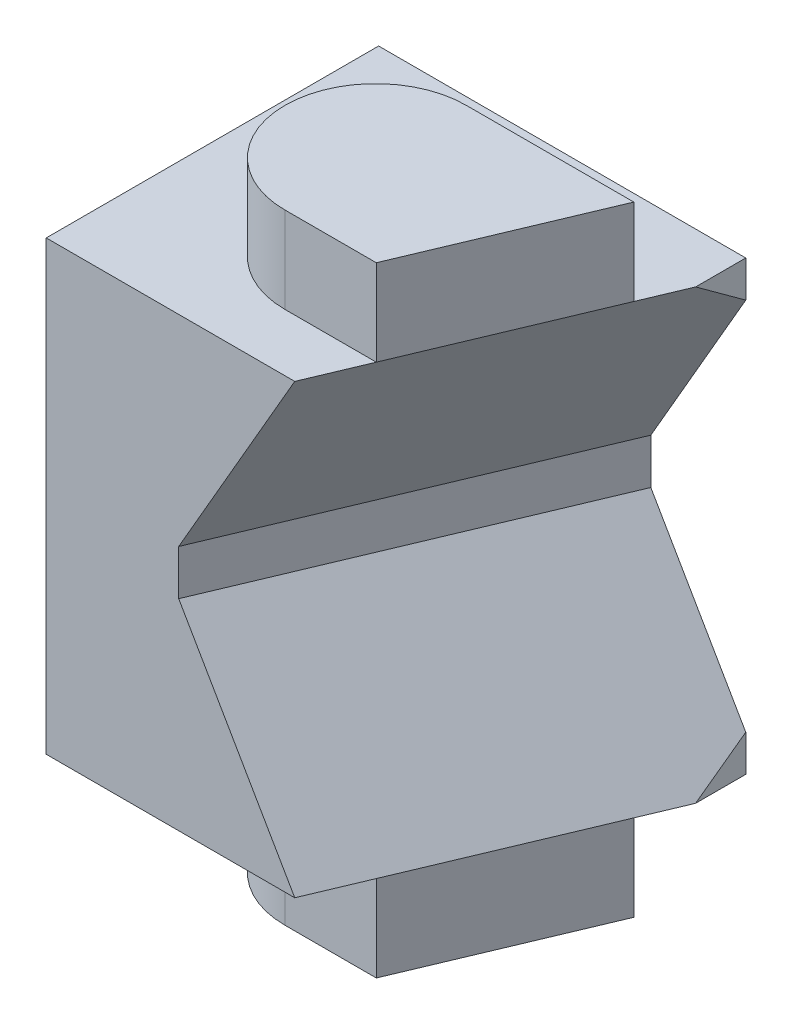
ISO-10303-21;
HEADER;
FILE_DESCRIPTION(('STEP AP214'),'2;1');
FILE_NAME('part.step','',(''),(''),'','','');
FILE_SCHEMA(('AUTOMOTIVE_DESIGN { 1 0 10303 214 1 1 1 1 }'));
ENDSEC;
DATA;
#1=APPLICATION_CONTEXT('core data for automotive mechanical design processes');
#2=APPLICATION_PROTOCOL_DEFINITION('international standard','automotive_design',2000,#1);
#3=PRODUCT_CONTEXT('',#1,'mechanical');
#4=PRODUCT('Part','Part','',(#3));
#5=PRODUCT_RELATED_PRODUCT_CATEGORY('part','',(#4));
#6=PRODUCT_DEFINITION_FORMATION('','',#4);
#7=PRODUCT_DEFINITION_CONTEXT('part definition',#1,'design');
#8=PRODUCT_DEFINITION('design','',#6,#7);
#9=PRODUCT_DEFINITION_SHAPE('','',#8);
#10=(LENGTH_UNIT() NAMED_UNIT(*) SI_UNIT(.MILLI.,.METRE.));
#11=(NAMED_UNIT(*) PLANE_ANGLE_UNIT() SI_UNIT($,.RADIAN.));
#12=(NAMED_UNIT(*) SI_UNIT($,.STERADIAN.) SOLID_ANGLE_UNIT());
#13=UNCERTAINTY_MEASURE_WITH_UNIT(LENGTH_MEASURE(1.E-05),#10,'distance_accuracy_value','');
#14=(GEOMETRIC_REPRESENTATION_CONTEXT(3) GLOBAL_UNCERTAINTY_ASSIGNED_CONTEXT((#13)) GLOBAL_UNIT_ASSIGNED_CONTEXT((#10,
#11,#12)) REPRESENTATION_CONTEXT('',''));
#15=CARTESIAN_POINT('',(0.,0.,0.));
#16=DIRECTION('',(0.,0.,1.));
#17=DIRECTION('',(1.,0.,0.));
#18=AXIS2_PLACEMENT_3D('',#15,#16,#17);
#19=CARTESIAN_POINT('',(-1.50000000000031,0.,10.9999999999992));
#20=DIRECTION('',(-1.,0.,0.));
#21=DIRECTION('',(0.,0.27243634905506,-0.962173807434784));
#22=AXIS2_PLACEMENT_3D('',#19,#20,#21);
#23=CYLINDRICAL_SURFACE('',#22,7.);
#24=CARTESIAN_POINT('',(-2.50000000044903,0.,10.9999999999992));
#25=DIRECTION('',(1.,0.,0.));
#26=DIRECTION('',(0.,-0.27243634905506,0.962173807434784));
#27=AXIS2_PLACEMENT_3D('',#24,#25,#26);
#28=CIRCLE('',#27,7.00000000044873);
#29=CARTESIAN_POINT('',(-2.50000000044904,-1.90705444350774,17.7352166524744));
#30=VERTEX_POINT('',#29);
#31=EDGE_CURVE('E215',#30,#30,#28,.T.);
#32=ORIENTED_EDGE('',*,*,#31,.F.);
#33=EDGE_LOOP('',(#32));
#34=FACE_BOUND('',#33,.T.);
#35=CARTESIAN_POINT('',(-3.30000000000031,0.,10.9999999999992));
#36=DIRECTION('',(-1.,0.,0.));
#37=DIRECTION('',(0.,-1.,0.));
#38=AXIS2_PLACEMENT_3D('',#35,#36,#37);
#39=CIRCLE('',#38,7.);
#40=CARTESIAN_POINT('',(-3.30000000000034,-7.00000000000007,10.9999999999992));
#41=VERTEX_POINT('',#40);
#42=EDGE_CURVE('E364',#41,#41,#39,.T.);
#43=ORIENTED_EDGE('',*,*,#42,.F.);
#44=EDGE_LOOP('',(#43));
#45=FACE_BOUND('',#44,.T.);
#46=ADVANCED_FACE('F14',(#34,#45),#23,.T.);
#47=CARTESIAN_POINT('',(4.99999999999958,-14.8,-0.200000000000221));
#48=DIRECTION('',(0.,-1.,0.));
#49=DIRECTION('',(-1.,0.,0.));
#50=AXIS2_PLACEMENT_3D('',#47,#48,#49);
#51=PLANE('',#50);
#52=CARTESIAN_POINT('',(11.9999999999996,-14.8000000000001,12.2));
#53=DIRECTION('',(0.,1.,0.));
#54=DIRECTION('',(1.,0.,0.));
#55=AXIS2_PLACEMENT_3D('',#52,#53,#54);
#56=CIRCLE('',#55,6.);
#57=CARTESIAN_POINT('',(11.9999999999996,-14.8,6.19999999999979));
#58=VERTEX_POINT('',#57);
#59=CARTESIAN_POINT('',(11.9999999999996,-14.8000000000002,18.2));
#60=VERTEX_POINT('',#59);
#61=EDGE_CURVE('E31',#58,#60,#56,.T.);
#62=ORIENTED_EDGE('',*,*,#61,.T.);
#63=DIRECTION('',(1.,0.,0.));
#64=VECTOR('',#63,1.);
#65=CARTESIAN_POINT('',(11.9999999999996,-14.8000000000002,18.2));
#66=LINE('',#65,#64);
#67=CARTESIAN_POINT('',(18.0456686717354,-14.8000000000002,18.2));
#68=VERTEX_POINT('',#67);
#69=EDGE_CURVE('E159',#60,#68,#66,.T.);
#70=ORIENTED_EDGE('',*,*,#69,.T.);
#71=DIRECTION('',(-0.387449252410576,0.,0.921891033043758));
#72=VECTOR('',#71,1.);
#73=CARTESIAN_POINT('',(24.2999999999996,-14.8,3.31853634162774));
#74=LINE('',#73,#72);
#75=CARTESIAN_POINT('',(16.4486174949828,-14.8000000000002,22.));
#76=VERTEX_POINT('',#75);
#77=EDGE_CURVE('E158',#68,#76,#74,.T.);
#78=ORIENTED_EDGE('',*,*,#77,.T.);
#79=DIRECTION('',(-1.,0.,0.));
#80=VECTOR('',#79,1.);
#81=CARTESIAN_POINT('',(4.99999999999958,-14.8000000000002,22.));
#82=LINE('',#81,#80);
#83=CARTESIAN_POINT('',(-4.22037385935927E-13,-14.8000000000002,22.));
#84=VERTEX_POINT('',#83);
#85=EDGE_CURVE('E164',#76,#84,#82,.T.);
#86=ORIENTED_EDGE('',*,*,#85,.T.);
#87=DIRECTION('',(0.,0.,-1.));
#88=VECTOR('',#87,1.);
#89=CARTESIAN_POINT('',(-4.22037385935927E-13,-14.8,-0.200000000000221));
#90=LINE('',#89,#88);
#91=CARTESIAN_POINT('',(-4.22037385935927E-13,-14.8,-2.10900703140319E-13));
#92=VERTEX_POINT('',#91);
#93=EDGE_CURVE('E166',#84,#92,#90,.T.);
#94=ORIENTED_EDGE('',*,*,#93,.T.);
#95=DIRECTION('',(1.,0.,0.));
#96=VECTOR('',#95,1.);
#97=CARTESIAN_POINT('',(14.0228679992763,-14.8,-2.10900703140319E-13));
#98=LINE('',#97,#96);
#99=CARTESIAN_POINT('',(24.2999999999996,-14.8,-2.14370150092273E-13));
#100=VERTEX_POINT('',#99);
#101=EDGE_CURVE('E212',#100,#92,#98,.F.);
#102=ORIENTED_EDGE('',*,*,#101,.F.);
#103=DIRECTION('',(0.,0.,-1.));
#104=VECTOR('',#103,1.);
#105=CARTESIAN_POINT('',(24.2999999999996,-14.8,-0.200000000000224));
#106=LINE('',#105,#104);
#107=CARTESIAN_POINT('',(24.2999999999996,-14.8,3.31853634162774));
#108=VERTEX_POINT('',#107);
#109=EDGE_CURVE('E163',#100,#108,#106,.F.);
#110=ORIENTED_EDGE('',*,*,#109,.T.);
#111=CARTESIAN_POINT('',(23.0889881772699,-14.8000000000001,6.19999999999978));
#112=VERTEX_POINT('',#111);
#113=EDGE_CURVE('E155',#108,#112,#74,.T.);
#114=ORIENTED_EDGE('',*,*,#113,.T.);
#115=DIRECTION('',(-1.,0.,0.));
#116=VECTOR('',#115,1.);
#117=CARTESIAN_POINT('',(11.9999999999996,-14.8,6.19999999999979));
#118=LINE('',#117,#116);
#119=EDGE_CURVE('E146',#112,#58,#118,.T.);
#120=ORIENTED_EDGE('',*,*,#119,.T.);
#121=EDGE_LOOP('',(#62,#70,#78,#86,#94,#102,#110,#114,#120));
#122=FACE_BOUND('',#121,.T.);
#123=ADVANCED_FACE('F161',(#122),#51,.T.);
#124=CARTESIAN_POINT('',(4.99999999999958,-14.8000000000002,22.));
#125=DIRECTION('',(0.,0.,1.));
#126=DIRECTION('',(-1.,0.,0.));
#127=AXIS2_PLACEMENT_3D('',#124,#125,#126);
#128=PLANE('',#127);
#129=DIRECTION('',(0.,1.,0.));
#130=VECTOR('',#129,1.);
#131=CARTESIAN_POINT('',(-3.18689538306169E-13,14.8,22.));
#132=LINE('',#131,#130);
#133=CARTESIAN_POINT('',(-3.18689538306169E-13,14.8,22.));
#134=VERTEX_POINT('',#133);
#135=EDGE_CURVE('E203',#84,#134,#132,.T.);
#136=ORIENTED_EDGE('',*,*,#135,.F.);
#137=ORIENTED_EDGE('',*,*,#85,.F.);
#138=DIRECTION('',(0.5,-0.866025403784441,0.));
#139=VECTOR('',#138,1.);
#140=CARTESIAN_POINT('',(15.4444286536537,-13.0606939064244,22.));
#141=LINE('',#140,#139);
#142=CARTESIAN_POINT('',(8.76797929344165,-1.49674440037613,22.));
#143=VERTEX_POINT('',#142);
#144=EDGE_CURVE('E173',#143,#76,#141,.T.);
#145=ORIENTED_EDGE('',*,*,#144,.F.);
#146=DIRECTION('',(0.,-1.,0.));
#147=VECTOR('',#146,1.);
#148=CARTESIAN_POINT('',(8.76797929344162,-8.15000000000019,22.));
#149=LINE('',#148,#147);
#150=CARTESIAN_POINT('',(8.76797929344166,1.49674440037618,22.));
#151=VERTEX_POINT('',#150);
#152=EDGE_CURVE('E178',#151,#143,#149,.T.);
#153=ORIENTED_EDGE('',*,*,#152,.F.);
#154=DIRECTION('',(-0.5,-0.866025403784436,0.));
#155=VECTOR('',#154,1.);
#156=CARTESIAN_POINT('',(5.93584066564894,-3.40866359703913,22.));
#157=LINE('',#156,#155);
#158=CARTESIAN_POINT('',(16.448617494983,14.8,22.));
#159=VERTEX_POINT('',#158);
#160=EDGE_CURVE('E183',#159,#151,#157,.T.);
#161=ORIENTED_EDGE('',*,*,#160,.F.);
#162=DIRECTION('',(1.,0.,0.));
#163=VECTOR('',#162,1.);
#164=CARTESIAN_POINT('',(4.99999999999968,14.8,22.));
#165=LINE('',#164,#163);
#166=EDGE_CURVE('E18',#134,#159,#165,.T.);
#167=ORIENTED_EDGE('',*,*,#166,.F.);
#168=EDGE_LOOP('',(#136,#137,#145,#153,#161,#167));
#169=FACE_BOUND('',#168,.T.);
#170=ADVANCED_FACE('F247',(#169),#128,.T.);
#171=CARTESIAN_POINT('',(-3.70363462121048E-13,1.24415333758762E-13,11.));
#172=DIRECTION('',(1.,0.,0.));
#173=DIRECTION('',(0.,-1.,0.));
#174=AXIS2_PLACEMENT_3D('',#171,#172,#173);
#175=PLANE('',#174);
#176=CARTESIAN_POINT('',(-3.70363462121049E-13,0.,10.9999999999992));
#177=DIRECTION('',(1.,0.,0.));
#178=DIRECTION('',(0.,0.,1.));
#179=AXIS2_PLACEMENT_3D('',#176,#177,#178);
#180=CIRCLE('',#179,8.);
#181=CARTESIAN_POINT('',(-3.69031194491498E-13,-1.32676290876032E-13,18.9999999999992));
#182=VERTEX_POINT('',#181);
#183=EDGE_CURVE('E23',#182,#182,#180,.F.);
#184=ORIENTED_EDGE('',*,*,#183,.F.);
#185=EDGE_LOOP('',(#184));
#186=FACE_BOUND('',#185,.T.);
#187=DIRECTION('',(0.,0.,-1.));
#188=VECTOR('',#187,1.);
#189=CARTESIAN_POINT('',(-3.18689538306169E-13,14.8,22.));
#190=LINE('',#189,#188);
#191=CARTESIAN_POINT('',(-3.18689538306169E-13,14.8000000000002,0.));
#192=VERTEX_POINT('',#191);
#193=EDGE_CURVE('E193',#192,#134,#190,.F.);
#194=ORIENTED_EDGE('',*,*,#193,.F.);
#195=DIRECTION('',(0.,-1.,0.));
#196=VECTOR('',#195,1.);
#197=CARTESIAN_POINT('',(-4.22037385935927E-13,-14.8,-2.10900703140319E-13));
#198=LINE('',#197,#196);
#199=EDGE_CURVE('E199',#192,#92,#198,.T.);
#200=ORIENTED_EDGE('',*,*,#199,.T.);
#201=ORIENTED_EDGE('',*,*,#93,.F.);
#202=ORIENTED_EDGE('',*,*,#135,.T.);
#203=EDGE_LOOP('',(#194,#200,#201,#202));
#204=FACE_BOUND('',#203,.T.);
#205=ADVANCED_FACE('F248',(#186,#204),#175,.F.);
#206=CARTESIAN_POINT('',(4.99999999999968,14.8,22.));
#207=DIRECTION('',(0.,1.,0.));
#208=DIRECTION('',(1.,0.,0.));
#209=AXIS2_PLACEMENT_3D('',#206,#207,#208);
#210=PLANE('',#209);
#211=DIRECTION('',(-1.,0.,0.));
#212=VECTOR('',#211,1.);
#213=CARTESIAN_POINT('',(11.9999999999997,14.8,6.2));
#214=LINE('',#213,#212);
#215=CARTESIAN_POINT('',(23.08898817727,14.8,6.2));
#216=VERTEX_POINT('',#215);
#217=CARTESIAN_POINT('',(11.9999999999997,14.8,6.2));
#218=VERTEX_POINT('',#217);
#219=EDGE_CURVE('E265',#216,#218,#214,.T.);
#220=ORIENTED_EDGE('',*,*,#219,.F.);
#221=DIRECTION('',(-0.387449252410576,0.,0.921891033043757));
#222=VECTOR('',#221,1.);
#223=CARTESIAN_POINT('',(24.2999999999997,14.8,3.31853634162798));
#224=LINE('',#223,#222);
#225=CARTESIAN_POINT('',(24.2999999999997,14.8,3.31853634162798));
#226=VERTEX_POINT('',#225);
#227=EDGE_CURVE('E185',#226,#216,#224,.T.);
#228=ORIENTED_EDGE('',*,*,#227,.F.);
#229=DIRECTION('',(0.,0.,-1.));
#230=VECTOR('',#229,1.);
#231=CARTESIAN_POINT('',(24.2999999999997,14.8,10.9));
#232=LINE('',#231,#230);
#233=CARTESIAN_POINT('',(24.2999999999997,14.8000000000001,0.));
#234=VERTEX_POINT('',#233);
#235=EDGE_CURVE('E192',#234,#226,#232,.F.);
#236=ORIENTED_EDGE('',*,*,#235,.F.);
#237=DIRECTION('',(1.,0.,0.));
#238=VECTOR('',#237,1.);
#239=CARTESIAN_POINT('',(14.0228679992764,14.8000000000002,0.));
#240=LINE('',#239,#238);
#241=EDGE_CURVE('E231',#192,#234,#240,.T.);
#242=ORIENTED_EDGE('',*,*,#241,.F.);
#243=ORIENTED_EDGE('',*,*,#193,.T.);
#244=ORIENTED_EDGE('',*,*,#166,.T.);
#245=CARTESIAN_POINT('',(18.0456686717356,14.8,18.2));
#246=VERTEX_POINT('',#245);
#247=EDGE_CURVE('E188',#246,#159,#224,.T.);
#248=ORIENTED_EDGE('',*,*,#247,.F.);
#249=DIRECTION('',(1.,0.,0.));
#250=VECTOR('',#249,1.);
#251=CARTESIAN_POINT('',(11.9999999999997,14.8,18.2));
#252=LINE('',#251,#250);
#253=CARTESIAN_POINT('',(11.9999999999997,14.8,18.2));
#254=VERTEX_POINT('',#253);
#255=EDGE_CURVE('E39',#254,#246,#252,.T.);
#256=ORIENTED_EDGE('',*,*,#255,.F.);
#257=CARTESIAN_POINT('',(11.9999999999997,14.8,12.2));
#258=DIRECTION('',(0.,1.,0.));
#259=DIRECTION('',(1.,0.,0.));
#260=AXIS2_PLACEMENT_3D('',#257,#258,#259);
#261=CIRCLE('',#260,6.);
#262=EDGE_CURVE('E263',#218,#254,#261,.T.);
#263=ORIENTED_EDGE('',*,*,#262,.F.);
#264=EDGE_LOOP('',(#220,#228,#236,#242,#243,#244,#248,#256,#263));
#265=FACE_BOUND('',#264,.T.);
#266=ADVANCED_FACE('F251',(#265),#210,.T.);
#267=CARTESIAN_POINT('',(24.2999999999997,0.,10.9));
#268=DIRECTION('',(1.,0.,0.));
#269=DIRECTION('',(0.,-1.,0.));
#270=AXIS2_PLACEMENT_3D('',#267,#268,#269);
#271=PLANE('',#270);
#272=ORIENTED_EDGE('',*,*,#235,.T.);
#273=DIRECTION('',(0.,0.5885247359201,0.808479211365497));
#274=VECTOR('',#273,1.);
#275=CARTESIAN_POINT('',(24.2999999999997,12.3843031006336,0.));
#276=LINE('',#275,#274);
#277=CARTESIAN_POINT('',(24.2999999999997,12.3843031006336,0.));
#278=VERTEX_POINT('',#277);
#279=EDGE_CURVE('E189',#278,#226,#276,.T.);
#280=ORIENTED_EDGE('',*,*,#279,.F.);
#281=DIRECTION('',(0.,-1.,0.));
#282=VECTOR('',#281,1.);
#283=CARTESIAN_POINT('',(24.2999999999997,1.16384926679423E-13,-1.11022302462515E-13));
#284=LINE('',#283,#282);
#285=EDGE_CURVE('E228',#234,#278,#284,.T.);
#286=ORIENTED_EDGE('',*,*,#285,.F.);
#287=EDGE_LOOP('',(#272,#280,#286));
#288=FACE_BOUND('',#287,.T.);
#289=ADVANCED_FACE('F255',(#288),#271,.T.);
#290=CARTESIAN_POINT('',(9.43464357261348,-5.42869839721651,10.9));
#291=DIRECTION('',(0.813797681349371,-0.46984631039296,0.342020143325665));
#292=DIRECTION('',(-0.5,-0.866025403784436,0.));
#293=AXIS2_PLACEMENT_3D('',#290,#291,#292);
#294=PLANE('',#293);
#295=ORIENTED_EDGE('',*,*,#160,.T.);
#296=DIRECTION('',(-0.387515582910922,-0.00013518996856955,0.921863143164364));
#297=VECTOR('',#296,1.);
#298=CARTESIAN_POINT('',(18.015927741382,1.49997067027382,-1.04017510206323E-13));
#299=LINE('',#298,#297);
#300=CARTESIAN_POINT('',(18.015927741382,1.49997067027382,-1.00548063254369E-13));
#301=VERTEX_POINT('',#300);
#302=EDGE_CURVE('E180',#301,#151,#299,.T.);
#303=ORIENTED_EDGE('',*,*,#302,.F.);
#304=DIRECTION('',(-0.5,-0.866025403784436,0.));
#305=VECTOR('',#304,1.);
#306=CARTESIAN_POINT('',(24.2999999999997,12.3843031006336,0.));
#307=LINE('',#306,#305);
#308=EDGE_CURVE('E225',#278,#301,#307,.T.);
#309=ORIENTED_EDGE('',*,*,#308,.F.);
#310=ORIENTED_EDGE('',*,*,#279,.T.);
#311=ORIENTED_EDGE('',*,*,#227,.T.);
#312=DIRECTION('',(0.387449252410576,0.,-0.921891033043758));
#313=VECTOR('',#312,1.);
#314=CARTESIAN_POINT('',(23.08898817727,14.8,6.2));
#315=LINE('',#314,#313);
#316=EDGE_CURVE('E260',#246,#216,#315,.T.);
#317=ORIENTED_EDGE('',*,*,#316,.F.);
#318=ORIENTED_EDGE('',*,*,#247,.T.);
#319=EDGE_LOOP('',(#295,#303,#309,#310,#311,#317,#318));
#320=FACE_BOUND('',#319,.T.);
#321=ADVANCED_FACE('F257',(#320),#294,.T.);
#322=CARTESIAN_POINT('',(13.4339896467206,-8.15000000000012,10.9));
#323=DIRECTION('',(0.921863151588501,0.,0.387515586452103));
#324=DIRECTION('',(-0.387515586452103,0.,0.921863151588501));
#325=AXIS2_PLACEMENT_3D('',#322,#323,#324);
#326=PLANE('',#325);
#327=ORIENTED_EDGE('',*,*,#152,.T.);
#328=DIRECTION('',(-0.387515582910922,0.000135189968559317,0.921863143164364));
#329=VECTOR('',#328,1.);
#330=CARTESIAN_POINT('',(18.015927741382,-1.49997067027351,-1.24965988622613E-13));
#331=LINE('',#330,#329);
#332=CARTESIAN_POINT('',(18.015927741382,-1.49997067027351,-1.24965988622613E-13));
#333=VERTEX_POINT('',#332);
#334=EDGE_CURVE('E175',#333,#143,#331,.T.);
#335=ORIENTED_EDGE('',*,*,#334,.F.);
#336=DIRECTION('',(0.,-1.,0.));
#337=VECTOR('',#336,1.);
#338=CARTESIAN_POINT('',(18.015927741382,1.38325647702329E-13,-1.11022302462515E-13));
#339=LINE('',#338,#337);
#340=EDGE_CURVE('E222',#301,#333,#339,.T.);
#341=ORIENTED_EDGE('',*,*,#340,.F.);
#342=ORIENTED_EDGE('',*,*,#302,.T.);
#343=EDGE_LOOP('',(#327,#335,#341,#342));
#344=FACE_BOUND('',#343,.T.);
#345=ADVANCED_FACE('F243',(#344),#326,.T.);
#346=CARTESIAN_POINT('',(18.9432315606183,-11.0406591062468,10.9));
#347=DIRECTION('',(0.813797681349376,0.469846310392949,0.342020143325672));
#348=DIRECTION('',(0.5,-0.866025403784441,0.));
#349=AXIS2_PLACEMENT_3D('',#346,#347,#348);
#350=PLANE('',#349);
#351=ORIENTED_EDGE('',*,*,#113,.F.);
#352=DIRECTION('',(0.,-0.588524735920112,0.808479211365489));
#353=VECTOR('',#352,1.);
#354=CARTESIAN_POINT('',(24.2999999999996,-12.3843031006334,-2.00970875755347E-13));
#355=LINE('',#354,#353);
#356=CARTESIAN_POINT('',(24.2999999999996,-12.3843031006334,-2.00970875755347E-13));
#357=VERTEX_POINT('',#356);
#358=EDGE_CURVE('E171',#357,#108,#355,.T.);
#359=ORIENTED_EDGE('',*,*,#358,.F.);
#360=DIRECTION('',(0.5,-0.866025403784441,0.));
#361=VECTOR('',#360,1.);
#362=CARTESIAN_POINT('',(18.015927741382,-1.49997067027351,-1.2149654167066E-13));
#363=LINE('',#362,#361);
#364=EDGE_CURVE('E219',#333,#357,#363,.T.);
#365=ORIENTED_EDGE('',*,*,#364,.F.);
#366=ORIENTED_EDGE('',*,*,#334,.T.);
#367=ORIENTED_EDGE('',*,*,#144,.T.);
#368=ORIENTED_EDGE('',*,*,#77,.F.);
#369=DIRECTION('',(0.387449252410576,0.,-0.921891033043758));
#370=VECTOR('',#369,1.);
#371=CARTESIAN_POINT('',(23.0889881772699,-14.8000000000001,6.19999999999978));
#372=LINE('',#371,#370);
#373=EDGE_CURVE('E136',#68,#112,#372,.T.);
#374=ORIENTED_EDGE('',*,*,#373,.T.);
#375=EDGE_LOOP('',(#351,#359,#365,#366,#367,#368,#374));
#376=FACE_BOUND('',#375,.T.);
#377=ADVANCED_FACE('F154',(#376),#350,.T.);
#378=CARTESIAN_POINT('',(24.2999999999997,0.,10.9));
#379=DIRECTION('',(1.,0.,0.));
#380=DIRECTION('',(0.,-1.,0.));
#381=AXIS2_PLACEMENT_3D('',#378,#379,#380);
#382=PLANE('',#381);
#383=ORIENTED_EDGE('',*,*,#358,.T.);
#384=ORIENTED_EDGE('',*,*,#109,.F.);
#385=DIRECTION('',(0.,-1.,0.));
#386=VECTOR('',#385,1.);
#387=CARTESIAN_POINT('',(24.2999999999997,1.16384926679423E-13,-1.11022302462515E-13));
#388=LINE('',#387,#386);
#389=EDGE_CURVE('E216',#357,#100,#388,.T.);
#390=ORIENTED_EDGE('',*,*,#389,.F.);
#391=EDGE_LOOP('',(#383,#384,#390));
#392=FACE_BOUND('',#391,.T.);
#393=ADVANCED_FACE('F239',(#392),#382,.T.);
#394=CARTESIAN_POINT('',(14.0228679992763,1.52267341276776E-13,-1.07552855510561E-13));
#395=DIRECTION('',(0.,0.,-1.));
#396=DIRECTION('',(1.,0.,0.));
#397=AXIS2_PLACEMENT_3D('',#394,#395,#396);
#398=PLANE('',#397);
#399=ORIENTED_EDGE('',*,*,#241,.T.);
#400=ORIENTED_EDGE('',*,*,#285,.T.);
#401=ORIENTED_EDGE('',*,*,#308,.T.);
#402=ORIENTED_EDGE('',*,*,#340,.T.);
#403=ORIENTED_EDGE('',*,*,#364,.T.);
#404=ORIENTED_EDGE('',*,*,#389,.T.);
#405=ORIENTED_EDGE('',*,*,#101,.T.);
#406=ORIENTED_EDGE('',*,*,#199,.F.);
#407=EDGE_LOOP('',(#399,#400,#401,#402,#403,#404,#405,#406));
#408=FACE_BOUND('',#407,.T.);
#409=ADVANCED_FACE('F235',(#408),#398,.T.);
#410=CARTESIAN_POINT('',(11.9999999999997,14.8,12.2));
#411=DIRECTION('',(0.,1.,0.));
#412=DIRECTION('',(1.,0.,0.));
#413=AXIS2_PLACEMENT_3D('',#410,#411,#412);
#414=CYLINDRICAL_SURFACE('',#413,6.);
#415=CARTESIAN_POINT('',(11.9999999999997,20.5,12.2000000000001));
#416=DIRECTION('',(0.,1.,0.));
#417=DIRECTION('',(1.,0.,0.));
#418=AXIS2_PLACEMENT_3D('',#415,#416,#417);
#419=CIRCLE('',#418,6.);
#420=CARTESIAN_POINT('',(11.9999999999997,20.5,6.2));
#421=VERTEX_POINT('',#420);
#422=CARTESIAN_POINT('',(11.9999999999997,20.5,18.2));
#423=VERTEX_POINT('',#422);
#424=EDGE_CURVE('E274',#421,#423,#419,.T.);
#425=ORIENTED_EDGE('',*,*,#424,.F.);
#426=DIRECTION('',(0.,1.,0.));
#427=VECTOR('',#426,1.);
#428=CARTESIAN_POINT('',(11.9999999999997,14.8,6.2));
#429=LINE('',#428,#427);
#430=EDGE_CURVE('E208',#218,#421,#429,.T.);
#431=ORIENTED_EDGE('',*,*,#430,.F.);
#432=ORIENTED_EDGE('',*,*,#262,.T.);
#433=DIRECTION('',(0.,1.,0.));
#434=VECTOR('',#433,1.);
#435=CARTESIAN_POINT('',(11.9999999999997,14.8,18.2));
#436=LINE('',#435,#434);
#437=EDGE_CURVE('E273',#254,#423,#436,.T.);
#438=ORIENTED_EDGE('',*,*,#437,.T.);
#439=EDGE_LOOP('',(#425,#431,#432,#438));
#440=FACE_BOUND('',#439,.T.);
#441=ADVANCED_FACE('F293',(#440),#414,.T.);
#442=CARTESIAN_POINT('',(11.9999999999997,14.8,6.2));
#443=DIRECTION('',(0.,0.,-1.));
#444=DIRECTION('',(1.,0.,0.));
#445=AXIS2_PLACEMENT_3D('',#442,#443,#444);
#446=PLANE('',#445);
#447=DIRECTION('',(-1.,0.,0.));
#448=VECTOR('',#447,1.);
#449=CARTESIAN_POINT('',(11.9999999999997,20.5,6.2));
#450=LINE('',#449,#448);
#451=CARTESIAN_POINT('',(23.08898817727,20.5,6.2));
#452=VERTEX_POINT('',#451);
#453=EDGE_CURVE('E267',#452,#421,#450,.T.);
#454=ORIENTED_EDGE('',*,*,#453,.F.);
#455=DIRECTION('',(0.,1.,0.));
#456=VECTOR('',#455,1.);
#457=CARTESIAN_POINT('',(23.08898817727,14.8,6.2));
#458=LINE('',#457,#456);
#459=EDGE_CURVE('E287',#216,#452,#458,.T.);
#460=ORIENTED_EDGE('',*,*,#459,.F.);
#461=ORIENTED_EDGE('',*,*,#219,.T.);
#462=ORIENTED_EDGE('',*,*,#430,.T.);
#463=EDGE_LOOP('',(#454,#460,#461,#462));
#464=FACE_BOUND('',#463,.T.);
#465=ADVANCED_FACE('F299',(#464),#446,.T.);
#466=CARTESIAN_POINT('',(23.08898817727,14.8,6.2));
#467=DIRECTION('',(0.921891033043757,0.,0.387449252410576));
#468=DIRECTION('',(-0.387449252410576,0.,0.921891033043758));
#469=AXIS2_PLACEMENT_3D('',#466,#467,#468);
#470=PLANE('',#469);
#471=DIRECTION('',(0.387449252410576,0.,-0.921891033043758));
#472=VECTOR('',#471,1.);
#473=CARTESIAN_POINT('',(23.08898817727,20.5,6.2));
#474=LINE('',#473,#472);
#475=CARTESIAN_POINT('',(18.0456686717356,20.5,18.2));
#476=VERTEX_POINT('',#475);
#477=EDGE_CURVE('E281',#476,#452,#474,.T.);
#478=ORIENTED_EDGE('',*,*,#477,.F.);
#479=DIRECTION('',(0.,1.,0.));
#480=VECTOR('',#479,1.);
#481=CARTESIAN_POINT('',(18.0456686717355,14.8,18.2));
#482=LINE('',#481,#480);
#483=EDGE_CURVE('E289',#246,#476,#482,.T.);
#484=ORIENTED_EDGE('',*,*,#483,.F.);
#485=ORIENTED_EDGE('',*,*,#316,.T.);
#486=ORIENTED_EDGE('',*,*,#459,.T.);
#487=EDGE_LOOP('',(#478,#484,#485,#486));
#488=FACE_BOUND('',#487,.T.);
#489=ADVANCED_FACE('F301',(#488),#470,.T.);
#490=CARTESIAN_POINT('',(11.9999999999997,14.8,18.2));
#491=DIRECTION('',(0.,0.,1.));
#492=DIRECTION('',(-1.,0.,0.));
#493=AXIS2_PLACEMENT_3D('',#490,#491,#492);
#494=PLANE('',#493);
#495=DIRECTION('',(1.,0.,0.));
#496=VECTOR('',#495,1.);
#497=CARTESIAN_POINT('',(11.9999999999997,20.5,18.2));
#498=LINE('',#497,#496);
#499=EDGE_CURVE('E277',#423,#476,#498,.T.);
#500=ORIENTED_EDGE('',*,*,#499,.F.);
#501=ORIENTED_EDGE('',*,*,#437,.F.);
#502=ORIENTED_EDGE('',*,*,#255,.T.);
#503=ORIENTED_EDGE('',*,*,#483,.T.);
#504=EDGE_LOOP('',(#500,#501,#502,#503));
#505=FACE_BOUND('',#504,.T.);
#506=ADVANCED_FACE('F294',(#505),#494,.T.);
#507=CARTESIAN_POINT('',(15.6999999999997,20.5,9.6));
#508=DIRECTION('',(0.,1.,0.));
#509=DIRECTION('',(-1.,0.,0.));
#510=AXIS2_PLACEMENT_3D('',#507,#508,#509);
#511=PLANE('',#510);
#512=ORIENTED_EDGE('',*,*,#424,.T.);
#513=ORIENTED_EDGE('',*,*,#499,.T.);
#514=ORIENTED_EDGE('',*,*,#477,.T.);
#515=ORIENTED_EDGE('',*,*,#453,.T.);
#516=EDGE_LOOP('',(#512,#513,#514,#515));
#517=FACE_BOUND('',#516,.T.);
#518=ADVANCED_FACE('F16',(#517),#511,.T.);
#519=CARTESIAN_POINT('',(11.9999999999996,-14.8000000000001,12.2));
#520=DIRECTION('',(0.,-1.,0.));
#521=DIRECTION('',(-1.,0.,0.));
#522=AXIS2_PLACEMENT_3D('',#519,#520,#521);
#523=CYLINDRICAL_SURFACE('',#522,6.);
#524=CARTESIAN_POINT('',(11.9999999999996,-20.5,12.1999999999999));
#525=DIRECTION('',(0.,1.,0.));
#526=DIRECTION('',(1.,0.,0.));
#527=AXIS2_PLACEMENT_3D('',#524,#525,#526);
#528=CIRCLE('',#527,6.);
#529=CARTESIAN_POINT('',(11.9999999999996,-20.5,6.19999999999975));
#530=VERTEX_POINT('',#529);
#531=CARTESIAN_POINT('',(11.9999999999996,-20.5,18.2));
#532=VERTEX_POINT('',#531);
#533=EDGE_CURVE('E368',#530,#532,#528,.T.);
#534=ORIENTED_EDGE('',*,*,#533,.T.);
#535=DIRECTION('',(0.,-1.,0.));
#536=VECTOR('',#535,1.);
#537=CARTESIAN_POINT('',(11.9999999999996,-14.8000000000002,18.2));
#538=LINE('',#537,#536);
#539=EDGE_CURVE('E278',#60,#532,#538,.T.);
#540=ORIENTED_EDGE('',*,*,#539,.F.);
#541=ORIENTED_EDGE('',*,*,#61,.F.);
#542=DIRECTION('',(0.,-1.,0.));
#543=VECTOR('',#542,1.);
#544=CARTESIAN_POINT('',(11.9999999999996,-14.8,6.19999999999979));
#545=LINE('',#544,#543);
#546=EDGE_CURVE('E143',#58,#530,#545,.T.);
#547=ORIENTED_EDGE('',*,*,#546,.T.);
#548=EDGE_LOOP('',(#534,#540,#541,#547));
#549=FACE_BOUND('',#548,.T.);
#550=ADVANCED_FACE('F393',(#549),#523,.T.);
#551=CARTESIAN_POINT('',(11.9999999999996,-14.8000000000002,18.2));
#552=DIRECTION('',(0.,0.,-1.));
#553=DIRECTION('',(1.,0.,0.));
#554=AXIS2_PLACEMENT_3D('',#551,#552,#553);
#555=PLANE('',#554);
#556=DIRECTION('',(1.,0.,0.));
#557=VECTOR('',#556,1.);
#558=CARTESIAN_POINT('',(11.9999999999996,-20.5,18.2));
#559=LINE('',#558,#557);
#560=CARTESIAN_POINT('',(18.0456686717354,-20.5,18.2));
#561=VERTEX_POINT('',#560);
#562=EDGE_CURVE('E381',#532,#561,#559,.T.);
#563=ORIENTED_EDGE('',*,*,#562,.T.);
#564=DIRECTION('',(0.,-1.,0.));
#565=VECTOR('',#564,1.);
#566=CARTESIAN_POINT('',(18.0456686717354,-14.8000000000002,18.2));
#567=LINE('',#566,#565);
#568=EDGE_CURVE('E142',#68,#561,#567,.T.);
#569=ORIENTED_EDGE('',*,*,#568,.F.);
#570=ORIENTED_EDGE('',*,*,#69,.F.);
#571=ORIENTED_EDGE('',*,*,#539,.T.);
#572=EDGE_LOOP('',(#563,#569,#570,#571));
#573=FACE_BOUND('',#572,.T.);
#574=ADVANCED_FACE('F395',(#573),#555,.F.);
#575=CARTESIAN_POINT('',(23.0889881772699,-14.8000000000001,6.19999999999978));
#576=DIRECTION('',(-0.921891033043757,0.,-0.387449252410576));
#577=DIRECTION('',(0.387449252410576,0.,-0.921891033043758));
#578=AXIS2_PLACEMENT_3D('',#575,#576,#577);
#579=PLANE('',#578);
#580=DIRECTION('',(0.387449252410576,0.,-0.921891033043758));
#581=VECTOR('',#580,1.);
#582=CARTESIAN_POINT('',(23.0889881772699,-20.5,6.19999999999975));
#583=LINE('',#582,#581);
#584=CARTESIAN_POINT('',(23.0889881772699,-20.5,6.19999999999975));
#585=VERTEX_POINT('',#584);
#586=EDGE_CURVE('E139',#561,#585,#583,.T.);
#587=ORIENTED_EDGE('',*,*,#586,.T.);
#588=DIRECTION('',(0.,-1.,0.));
#589=VECTOR('',#588,1.);
#590=CARTESIAN_POINT('',(23.0889881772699,-14.8000000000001,6.19999999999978));
#591=LINE('',#590,#589);
#592=EDGE_CURVE('E131',#112,#585,#591,.T.);
#593=ORIENTED_EDGE('',*,*,#592,.F.);
#594=ORIENTED_EDGE('',*,*,#373,.F.);
#595=ORIENTED_EDGE('',*,*,#568,.T.);
#596=EDGE_LOOP('',(#587,#593,#594,#595));
#597=FACE_BOUND('',#596,.T.);
#598=ADVANCED_FACE('F133',(#597),#579,.F.);
#599=CARTESIAN_POINT('',(11.9999999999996,-14.8,6.19999999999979));
#600=DIRECTION('',(0.,0.,1.));
#601=DIRECTION('',(-1.,0.,0.));
#602=AXIS2_PLACEMENT_3D('',#599,#600,#601);
#603=PLANE('',#602);
#604=DIRECTION('',(-1.,0.,0.));
#605=VECTOR('',#604,1.);
#606=CARTESIAN_POINT('',(11.9999999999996,-20.5,6.19999999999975));
#607=LINE('',#606,#605);
#608=EDGE_CURVE('E386',#585,#530,#607,.T.);
#609=ORIENTED_EDGE('',*,*,#608,.T.);
#610=ORIENTED_EDGE('',*,*,#546,.F.);
#611=ORIENTED_EDGE('',*,*,#119,.F.);
#612=ORIENTED_EDGE('',*,*,#592,.T.);
#613=EDGE_LOOP('',(#609,#610,#611,#612));
#614=FACE_BOUND('',#613,.T.);
#615=ADVANCED_FACE('F147',(#614),#603,.F.);
#616=CARTESIAN_POINT('',(12.6545990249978,-20.5,12.1999999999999));
#617=DIRECTION('',(0.,-1.,0.));
#618=DIRECTION('',(-1.,0.,0.));
#619=AXIS2_PLACEMENT_3D('',#616,#617,#618);
#620=PLANE('',#619);
#621=ORIENTED_EDGE('',*,*,#533,.F.);
#622=ORIENTED_EDGE('',*,*,#608,.F.);
#623=ORIENTED_EDGE('',*,*,#586,.F.);
#624=ORIENTED_EDGE('',*,*,#562,.F.);
#625=EDGE_LOOP('',(#621,#622,#623,#624));
#626=FACE_BOUND('',#625,.T.);
#627=ADVANCED_FACE('F327',(#626),#620,.T.);
#628=CARTESIAN_POINT('',(-1.49999999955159,0.,10.9999999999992));
#629=DIRECTION('',(1.,0.,0.));
#630=DIRECTION('',(0.,-0.962173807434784,-0.27243634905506));
#631=AXIS2_PLACEMENT_3D('',#628,#629,#630);
#632=CONICAL_SURFACE('',#631,7.99999999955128,0.785398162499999);
#633=CARTESIAN_POINT('',(-1.50000000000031,0.,10.9999999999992));
#634=DIRECTION('',(-1.,0.,0.));
#635=DIRECTION('',(0.,0.27243634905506,-0.962173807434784));
#636=AXIS2_PLACEMENT_3D('',#633,#634,#635);
#637=CIRCLE('',#636,8.);
#638=CARTESIAN_POINT('',(-1.5000000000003,2.17949079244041,3.30260954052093));
#639=VERTEX_POINT('',#638);
#640=EDGE_CURVE('E370',#639,#639,#637,.F.);
#641=ORIENTED_EDGE('',*,*,#640,.F.);
#642=EDGE_LOOP('',(#641));
#643=FACE_BOUND('',#642,.T.);
#644=ORIENTED_EDGE('',*,*,#31,.T.);
#645=EDGE_LOOP('',(#644));
#646=FACE_BOUND('',#645,.T.);
#647=ADVANCED_FACE('F315',(#643,#646),#632,.T.);
#648=CARTESIAN_POINT('',(8.49999999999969,-1.06490180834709E-13,10.9999999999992));
#649=DIRECTION('',(-1.,0.,0.));
#650=DIRECTION('',(0.,0.27243634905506,-0.962173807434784));
#651=AXIS2_PLACEMENT_3D('',#648,#649,#650);
#652=CYLINDRICAL_SURFACE('',#651,8.);
#653=ORIENTED_EDGE('',*,*,#640,.T.);
#654=EDGE_LOOP('',(#653));
#655=FACE_BOUND('',#654,.T.);
#656=ORIENTED_EDGE('',*,*,#183,.T.);
#657=EDGE_LOOP('',(#656));
#658=FACE_BOUND('',#657,.T.);
#659=ADVANCED_FACE('F321',(#655,#658),#652,.T.);
#660=CARTESIAN_POINT('',(-3.30000000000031,0.,10.9999999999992));
#661=DIRECTION('',(-1.,0.,0.));
#662=DIRECTION('',(0.,-1.,0.));
#663=AXIS2_PLACEMENT_3D('',#660,#661,#662);
#664=PLANE('',#663);
#665=CARTESIAN_POINT('',(-3.30000000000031,0.,10.9999999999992));
#666=DIRECTION('',(-1.,0.,0.));
#667=DIRECTION('',(0.,-1.,0.));
#668=AXIS2_PLACEMENT_3D('',#665,#666,#667);
#669=CIRCLE('',#668,6.);
#670=CARTESIAN_POINT('',(-3.30000000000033,-6.00000000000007,10.9999999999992));
#671=VERTEX_POINT('',#670);
#672=EDGE_CURVE('E361',#671,#671,#669,.T.);
#673=ORIENTED_EDGE('',*,*,#672,.F.);
#674=EDGE_LOOP('',(#673));
#675=FACE_BOUND('',#674,.T.);
#676=ORIENTED_EDGE('',*,*,#42,.T.);
#677=EDGE_LOOP('',(#676));
#678=FACE_BOUND('',#677,.T.);
#679=ADVANCED_FACE('F334',(#675,#678),#664,.T.);
#680=CARTESIAN_POINT('',(-1.39452919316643,0.,10.9999999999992));
#681=DIRECTION('',(-1.,0.,0.));
#682=DIRECTION('',(0.,-0.707106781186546,-0.70710678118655));
#683=AXIS2_PLACEMENT_3D('',#680,#681,#682);
#684=SPHERICAL_SURFACE('',#683,6.);
#685=CARTESIAN_POINT('',(-1.39500000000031,0.,10.9999999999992));
#686=DIRECTION('',(-1.,0.,0.));
#687=DIRECTION('',(0.,1.,0.));
#688=AXIS2_PLACEMENT_3D('',#685,#686,#687);
#689=CIRCLE('',#688,5.99999998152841);
#690=CARTESIAN_POINT('',(-1.39500000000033,-4.24264067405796,6.75735932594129));
#691=VERTEX_POINT('',#690);
#692=EDGE_CURVE('E9',#691,#691,#689,.F.);
#693=CARTESIAN_POINT('',(-5.00000000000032,0.,10.9999999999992));
#694=DIRECTION('',(1.,0.,0.));
#695=DIRECTION('',(0.,0.,-1.));
#696=AXIS2_PLACEMENT_3D('',#693,#694,#695);
#697=CIRCLE('',#696,4.79589201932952);
#698=CARTESIAN_POINT('',(-5.00000000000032,-3.39120776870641,7.60879223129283));
#699=VERTEX_POINT('',#698);
#700=EDGE_CURVE('E359',#699,#699,#697,.T.);
#701=CARTESIAN_POINT('',(-1.39500000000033,-4.24264067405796,6.75735932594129));
#702=CARTESIAN_POINT('',(-1.43528518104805,-4.24263848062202,6.75736151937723));
#703=CARTESIAN_POINT('',(-1.47557032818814,-4.24234931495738,6.75765068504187));
#704=CARTESIAN_POINT('',(-1.55612421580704,-4.24119734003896,6.75880265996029));
#705=CARTESIAN_POINT('',(-1.59639295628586,-4.24033453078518,6.75966546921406));
#706=CARTESIAN_POINT('',(-1.67689769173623,-4.23803556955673,6.76196443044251));
#707=CARTESIAN_POINT('',(-1.71713368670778,-4.23659941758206,6.76340058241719));
#708=CARTESIAN_POINT('',(-1.79755660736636,-4.2331543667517,6.76684563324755));
#709=CARTESIAN_POINT('',(-1.8377435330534,-4.23114546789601,6.76885453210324));
#710=CARTESIAN_POINT('',(-1.91805201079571,-4.22655573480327,6.77344426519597));
#711=CARTESIAN_POINT('',(-1.95817356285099,-4.22397490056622,6.77602509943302));
#712=CARTESIAN_POINT('',(-2.03833501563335,-4.21824234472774,6.7817576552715));
#713=CARTESIAN_POINT('',(-2.07837491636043,-4.21509062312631,6.78490937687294));
#714=CARTESIAN_POINT('',(-2.15835682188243,-4.20821757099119,6.79178242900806));
#715=CARTESIAN_POINT('',(-2.19829882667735,-4.20449624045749,6.79550375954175));
#716=CARTESIAN_POINT('',(-2.27806873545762,-4.19648548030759,6.80351451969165));
#717=CARTESIAN_POINT('',(-2.31789663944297,-4.19219605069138,6.80780394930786));
#718=CARTESIAN_POINT('',(-2.39742218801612,-4.18305083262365,6.81694916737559));
#719=CARTESIAN_POINT('',(-2.43711983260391,-4.17819504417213,6.82180495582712));
#720=CARTESIAN_POINT('',(-2.51636875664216,-4.16791907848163,6.83208092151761));
#721=CARTESIAN_POINT('',(-2.55592003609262,-4.16249890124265,6.83750109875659));
#722=CARTESIAN_POINT('',(-2.6348601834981,-4.15109635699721,6.84890364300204));
#723=CARTESIAN_POINT('',(-2.67424905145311,-4.14511398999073,6.85488601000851));
#724=CARTESIAN_POINT('',(-2.75284839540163,-4.13258949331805,6.86741050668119));
#725=CARTESIAN_POINT('',(-2.79205887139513,-4.12604736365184,6.8739526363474));
#726=CARTESIAN_POINT('',(-2.87028552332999,-4.11240599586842,6.88759400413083));
#727=CARTESIAN_POINT('',(-2.90930169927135,-4.1053067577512,6.89469324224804));
#728=CARTESIAN_POINT('',(-2.9871239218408,-4.09055405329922,6.90944594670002));
#729=CARTESIAN_POINT('',(-3.02592996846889,-4.08290058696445,6.9170994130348));
#730=CARTESIAN_POINT('',(-3.10331618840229,-4.06704253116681,6.93295746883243));
#731=CARTESIAN_POINT('',(-3.14189636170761,-4.05883794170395,6.94116205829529));
#732=CARTESIAN_POINT('',(-3.21881518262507,-4.04188096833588,6.95811903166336));
#733=CARTESIAN_POINT('',(-3.25715383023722,-4.03312858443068,6.96687141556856));
#734=CARTESIAN_POINT('',(-3.33357404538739,-4.01507957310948,6.98492042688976));
#735=CARTESIAN_POINT('',(-3.37165561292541,-4.0057829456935,6.99421705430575));
#736=CARTESIAN_POINT('',(-3.4475462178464,-3.98664921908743,7.01335078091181));
#737=CARTESIAN_POINT('',(-3.48535525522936,-3.97681211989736,7.02318788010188));
#738=CARTESIAN_POINT('',(-3.56068546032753,-3.95660144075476,7.04339855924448));
#739=CARTESIAN_POINT('',(-3.59820662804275,-3.94622786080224,7.05377213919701));
#740=CARTESIAN_POINT('',(-3.67294587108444,-3.92494842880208,7.07505157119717));
#741=CARTESIAN_POINT('',(-3.71016394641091,-3.91404257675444,7.0859574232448));
#742=CARTESIAN_POINT('',(-3.78428190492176,-3.89170302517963,7.10829697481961));
#743=CARTESIAN_POINT('',(-3.82118178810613,-3.88026932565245,7.11973067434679));
#744=CARTESIAN_POINT('',(-3.89464839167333,-3.85687871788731,7.14312128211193));
#745=CARTESIAN_POINT('',(-3.93121511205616,-3.84492180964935,7.15507819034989));
#746=CARTESIAN_POINT('',(-4.004000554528,-3.82048963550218,7.17951036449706));
#747=CARTESIAN_POINT('',(-4.04021927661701,-3.80801436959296,7.19198563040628));
#748=CARTESIAN_POINT('',(-4.11229402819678,-3.78255054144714,7.2174494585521));
#749=CARTESIAN_POINT('',(-4.14815005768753,-3.76956197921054,7.2304380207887));
#750=CARTESIAN_POINT('',(-4.21948487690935,-3.74307682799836,7.25692317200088));
#751=CARTESIAN_POINT('',(-4.2549636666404,-3.72958023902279,7.27041976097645));
#752=CARTESIAN_POINT('',(-4.32552961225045,-3.70208451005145,7.29791548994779));
#753=CARTESIAN_POINT('',(-4.36061676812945,-3.68808537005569,7.31191462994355));
#754=CARTESIAN_POINT('',(-4.43038521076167,-3.65959021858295,7.34040978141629));
#755=CARTESIAN_POINT('',(-4.4650664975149,-3.64509420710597,7.35490579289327));
#756=CARTESIAN_POINT('',(-4.53400913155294,-3.61561119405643,7.38438880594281));
#757=CARTESIAN_POINT('',(-4.56827047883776,-3.60062419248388,7.39937580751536));
#758=CARTESIAN_POINT('',(-4.63635933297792,-3.57016527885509,7.42983472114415));
#759=CARTESIAN_POINT('',(-4.67018683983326,-3.55469336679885,7.44530663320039));
#760=CARTESIAN_POINT('',(-4.7373942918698,-3.52327091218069,7.47672908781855));
#761=CARTESIAN_POINT('',(-4.770774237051,-3.50732036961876,7.49267963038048));
#762=CARTESIAN_POINT('',(-4.83707301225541,-3.47494711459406,7.52505288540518));
#763=CARTESIAN_POINT('',(-4.86999184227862,-3.45852440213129,7.54147559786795));
#764=CARTESIAN_POINT('',(-4.93535507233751,-3.42521351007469,7.57478648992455));
#765=CARTESIAN_POINT('',(-4.96779947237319,-3.40832533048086,7.59167466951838));
#766=CARTESIAN_POINT('',(-5.00000000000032,-3.39120776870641,7.60879223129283));
#767=B_SPLINE_CURVE_WITH_KNOTS('',3,(#701,#702,#703,#704,#705,#706,#707,#708,#709,#710,#711,
#712,#713,#714,#715,#716,#717,#718,#719,#720,#721,#722,#723,#724,#725,#726,#727,#728,#729,#730,
#731,#732,#733,#734,#735,#736,#737,#738,#739,#740,#741,#742,#743,#744,#745,#746,#747,#748,#749,
#750,#751,#752,#753,#754,#755,#756,#757,#758,#759,#760,#761,#762,#763,#764,#765,#766),
.UNSPECIFIED.,.F.,.F.,(4,2,2,2,2,2,2,2,2,2,2,2,2,2,2,2,2,2,2,2,2,2,2,2,2,2,2,2,2,2,2,2,4),(0.,
0.120853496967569,0.241706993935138,0.362560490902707,0.483413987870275,0.604267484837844,
0.725120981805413,0.845974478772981,0.96682797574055,1.08768147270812,1.20853496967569,
1.32938846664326,1.45024196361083,1.57109546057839,1.69194895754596,1.81280245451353,
1.9336559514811,2.05450944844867,2.17536294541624,2.29621644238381,2.41706993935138,
2.53792343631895,2.65877693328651,2.77963043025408,2.90048392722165,3.02133742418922,
3.14219092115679,3.26304441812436,3.38389791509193,3.5047514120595,3.62560490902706,
3.74645840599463,3.8673119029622),.UNSPECIFIED.);
#768=EDGE_CURVE('BSEAM341',#691,#699,#767,.T.);
#769=ORIENTED_EDGE('',*,*,#692,.F.);
#770=ORIENTED_EDGE('',*,*,#700,.T.);
#771=ORIENTED_EDGE('',*,*,#768,.T.);
#772=ORIENTED_EDGE('',*,*,#768,.F.);
#773=EDGE_LOOP('',(#769,#771,#770,#772));
#774=FACE_BOUND('',#773,.T.);
#775=ADVANCED_FACE('F341',(#774),#684,.T.);
#776=CARTESIAN_POINT('',(-4.00000000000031,0.,10.9999999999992));
#777=DIRECTION('',(1.,0.,0.));
#778=DIRECTION('',(0.,-0.962173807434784,-0.27243634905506));
#779=AXIS2_PLACEMENT_3D('',#776,#777,#778);
#780=CYLINDRICAL_SURFACE('',#779,6.);
#781=ORIENTED_EDGE('',*,*,#692,.T.);
#782=EDGE_LOOP('',(#781));
#783=FACE_BOUND('',#782,.T.);
#784=ORIENTED_EDGE('',*,*,#672,.T.);
#785=EDGE_LOOP('',(#784));
#786=FACE_BOUND('',#785,.T.);
#787=ADVANCED_FACE('F344',(#783,#786),#780,.F.);
#788=CARTESIAN_POINT('',(-5.00000000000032,0.,10.9999999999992));
#789=DIRECTION('',(1.,0.,0.));
#790=DIRECTION('',(0.,0.,-1.));
#791=AXIS2_PLACEMENT_3D('',#788,#789,#790);
#792=PLANE('',#791);
#793=ORIENTED_EDGE('',*,*,#700,.F.);
#794=EDGE_LOOP('',(#793));
#795=FACE_BOUND('',#794,.T.);
#796=ADVANCED_FACE('F349',(#795),#792,.F.);
#797=CLOSED_SHELL('',(#46,#123,#170,#205,#266,#289,#321,#345,#377,#393,#409,#441,#465,#489,#506,
#518,#550,#574,#598,#615,#627,#647,#659,#679,#775,#787,#796));
#798=MANIFOLD_SOLID_BREP('B1',#797);
#799=ADVANCED_BREP_SHAPE_REPRESENTATION('',(#18,#798),#14);
#800=SHAPE_DEFINITION_REPRESENTATION(#9,#799);
ENDSEC;
END-ISO-10303-21;
